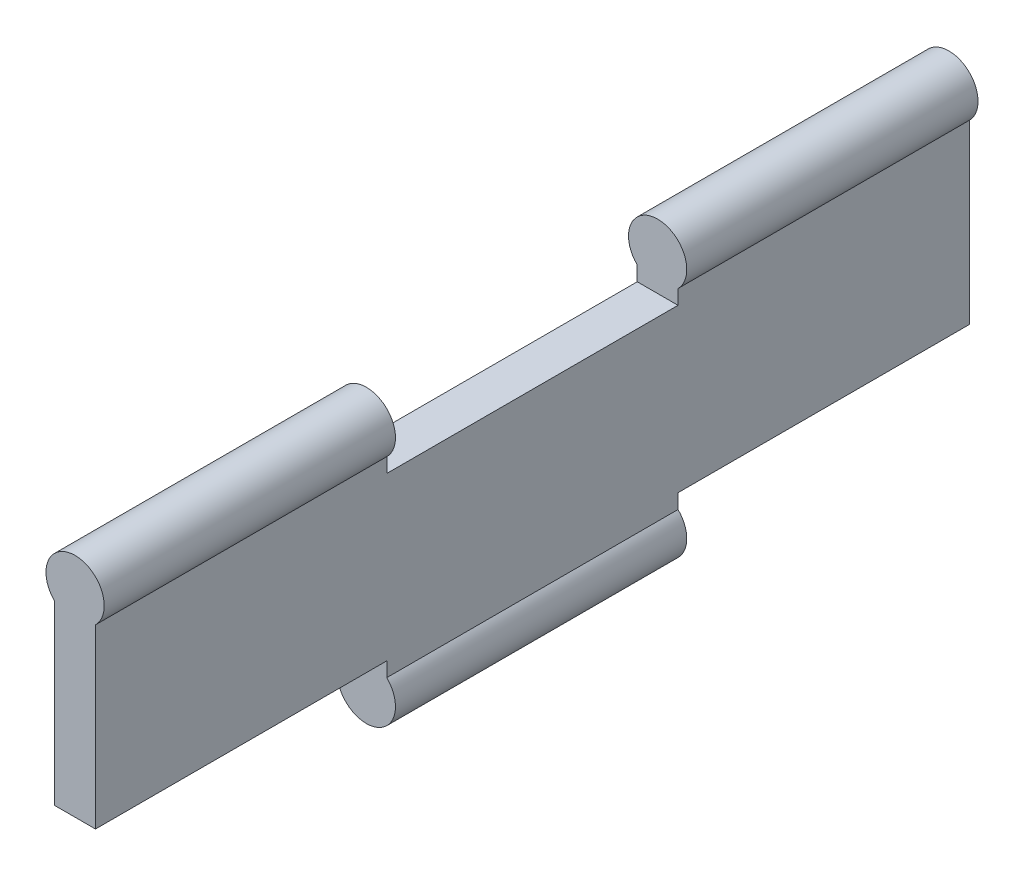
from build123d import *

# Parameters (mm, degrees)
DODANIE_WYCI_GNI_CIE1_DEPTH     = 300
WYTNIJ_WYCI_GNI_CIE1_DEPTH      = 75
WYTNIJ_WYCI_GNI_CIE1_DEPTH_BACK = 103
SZKIC2_W                        = 100
SZKIC2_H                        = 44.282856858
SZKIC2_W_2                      = 138.842705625
SZKIC2_W_3                      = 111.252364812


with BuildPart() as part:
    # Szkic1 → Dodanie-wyci_gni_cie1 (new body)
    with BuildSketch(Plane.XY):
        with BuildLine():
            Line((-7, 72.858571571), (-7, 7.141428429))
            ThreePointArc((-7, 7.141428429), (0, -10), (7, 7.141428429))
            Line((7, 7.141428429), (7, 72.858571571))
            ThreePointArc((7, 72.858571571), (0, 90), (-7, 72.858571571))
        make_face()
    extrude(amount=DODANIE_WYCI_GNI_CIE1_DEPTH)

    # Szkic2 → Wytnij-wyci_gni_cie1 (cut, two sides: drawn at the far end of the back side and taken through both)
    with BuildSketch(Plane(origin=(7, 0, 0), x_dir=(0, 0, -1), z_dir=(1, 0, 0)).offset(-WYTNIJ_WYCI_GNI_CIE1_DEPTH_BACK)):
        with Locations((-150, 90)):
            Rectangle(SZKIC2_W, SZKIC2_H)
        with Locations((-269.421352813, -10)):
            Rectangle(SZKIC2_W_2, SZKIC2_H)
        with Locations((-44.373817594, -10)):
            Rectangle(SZKIC2_W_3, SZKIC2_H)
    extrude(amount=WYTNIJ_WYCI_GNI_CIE1_DEPTH + WYTNIJ_WYCI_GNI_CIE1_DEPTH_BACK, mode=Mode.SUBTRACT)


solid = part.part
